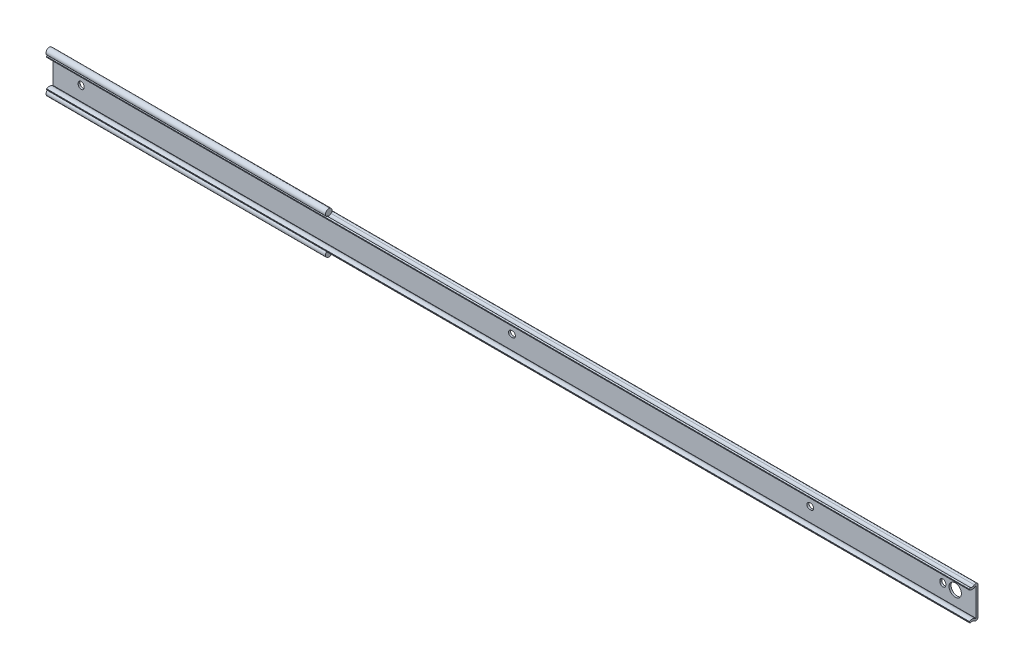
ISO-10303-21;
HEADER;
FILE_DESCRIPTION(('STEP AP214'),'2;1');
FILE_NAME('part.step','',(''),(''),'','','');
FILE_SCHEMA(('AUTOMOTIVE_DESIGN { 1 0 10303 214 1 1 1 1 }'));
ENDSEC;
DATA;
#1=APPLICATION_CONTEXT('core data for automotive mechanical design processes');
#2=APPLICATION_PROTOCOL_DEFINITION('international standard','automotive_design',2000,#1);
#3=PRODUCT_CONTEXT('',#1,'mechanical');
#4=PRODUCT('Part','Part','',(#3));
#5=PRODUCT_RELATED_PRODUCT_CATEGORY('part','',(#4));
#6=PRODUCT_DEFINITION_FORMATION('','',#4);
#7=PRODUCT_DEFINITION_CONTEXT('part definition',#1,'design');
#8=PRODUCT_DEFINITION('design','',#6,#7);
#9=PRODUCT_DEFINITION_SHAPE('','',#8);
#10=(LENGTH_UNIT() NAMED_UNIT(*) SI_UNIT(.MILLI.,.METRE.));
#11=(NAMED_UNIT(*) PLANE_ANGLE_UNIT() SI_UNIT($,.RADIAN.));
#12=(NAMED_UNIT(*) SI_UNIT($,.STERADIAN.) SOLID_ANGLE_UNIT());
#13=UNCERTAINTY_MEASURE_WITH_UNIT(LENGTH_MEASURE(1.E-05),#10,'distance_accuracy_value','');
#14=(GEOMETRIC_REPRESENTATION_CONTEXT(3) GLOBAL_UNCERTAINTY_ASSIGNED_CONTEXT((#13)) GLOBAL_UNIT_ASSIGNED_CONTEXT((#10,
#11,#12)) REPRESENTATION_CONTEXT('',''));
#15=CARTESIAN_POINT('',(0.,0.,0.));
#16=DIRECTION('',(0.,0.,1.));
#17=DIRECTION('',(1.,0.,0.));
#18=AXIS2_PLACEMENT_3D('',#15,#16,#17);
#19=CARTESIAN_POINT('',(-21.4,13.9150000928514,4.44999970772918));
#20=DIRECTION('',(1.,0.,0.));
#21=DIRECTION('',(0.,0.,-1.));
#22=AXIS2_PLACEMENT_3D('',#19,#20,#21);
#23=CYLINDRICAL_SURFACE('',#22,2.55000008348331);
#24=DIRECTION('',(1.,0.,0.));
#25=VECTOR('',#24,1.);
#26=CARTESIAN_POINT('',(-21.4,12.0053612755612,2.76009438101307));
#27=LINE('',#26,#25);
#28=CARTESIAN_POINT('',(192.8,12.0053612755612,2.76009438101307));
#29=VERTEX_POINT('',#28);
#30=CARTESIAN_POINT('',(685.8,12.0053612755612,2.76009438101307));
#31=VERTEX_POINT('',#30);
#32=EDGE_CURVE('E406',#29,#31,#27,.T.);
#33=ORIENTED_EDGE('',*,*,#32,.F.);
#34=CARTESIAN_POINT('',(192.8,13.9150000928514,4.44999970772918));
#35=DIRECTION('',(-1.,0.,0.));
#36=DIRECTION('',(0.,0.,1.));
#37=AXIS2_PLACEMENT_3D('',#34,#35,#36);
#38=CIRCLE('',#37,2.55000008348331);
#39=CARTESIAN_POINT('',(192.8,11.8784794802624,5.98462807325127));
#40=VERTEX_POINT('',#39);
#41=EDGE_CURVE('E468',#29,#40,#38,.T.);
#42=ORIENTED_EDGE('',*,*,#41,.T.);
#43=DIRECTION('',(1.,0.,0.));
#44=VECTOR('',#43,1.);
#45=CARTESIAN_POINT('',(-21.4,11.8784794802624,5.98462807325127));
#46=LINE('',#45,#44);
#47=CARTESIAN_POINT('',(685.8,11.8784794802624,5.98462807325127));
#48=VERTEX_POINT('',#47);
#49=EDGE_CURVE('E432',#40,#48,#46,.T.);
#50=ORIENTED_EDGE('',*,*,#49,.T.);
#51=CARTESIAN_POINT('',(685.8,13.9150000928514,4.44999970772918));
#52=DIRECTION('',(-1.,0.,0.));
#53=DIRECTION('',(0.,0.,-1.));
#54=AXIS2_PLACEMENT_3D('',#51,#52,#53);
#55=CIRCLE('',#54,2.55000008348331);
#56=EDGE_CURVE('E336',#31,#48,#55,.T.);
#57=ORIENTED_EDGE('',*,*,#56,.F.);
#58=EDGE_LOOP('',(#33,#42,#50,#57));
#59=FACE_BOUND('',#58,.T.);
#60=ADVANCED_FACE('F14',(#59),#23,.F.);
#61=CARTESIAN_POINT('',(-21.4,10.762224,1.65999962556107));
#62=DIRECTION('',(1.,0.,0.));
#63=DIRECTION('',(0.,0.,-1.));
#64=AXIS2_PLACEMENT_3D('',#61,#62,#63);
#65=CYLINDRICAL_SURFACE('',#64,1.65999962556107);
#66=DIRECTION('',(-1.,0.,0.));
#67=VECTOR('',#66,1.);
#68=CARTESIAN_POINT('',(85.7,12.2965303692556,2.29364205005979));
#69=LINE('',#68,#67);
#70=CARTESIAN_POINT('',(192.8,12.2965303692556,2.29364205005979));
#71=VERTEX_POINT('',#70);
#72=CARTESIAN_POINT('',(-21.4,12.2965303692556,2.29364205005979));
#73=VERTEX_POINT('',#72);
#74=EDGE_CURVE('E316',#71,#73,#69,.T.);
#75=ORIENTED_EDGE('',*,*,#74,.F.);
#76=CARTESIAN_POINT('',(192.8,10.762224,1.65999962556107));
#77=DIRECTION('',(-1.,0.,0.));
#78=DIRECTION('',(0.,0.,1.));
#79=AXIS2_PLACEMENT_3D('',#76,#77,#78);
#80=CIRCLE('',#79,1.65999962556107);
#81=EDGE_CURVE('E489',#71,#29,#80,.F.);
#82=ORIENTED_EDGE('',*,*,#81,.T.);
#83=ORIENTED_EDGE('',*,*,#32,.T.);
#84=CARTESIAN_POINT('',(685.8,10.762224,1.65999962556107));
#85=DIRECTION('',(1.,0.,0.));
#86=DIRECTION('',(0.,0.,-1.));
#87=AXIS2_PLACEMENT_3D('',#84,#85,#86);
#88=CIRCLE('',#87,1.65999962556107);
#89=CARTESIAN_POINT('',(685.8,10.762224,0.));
#90=VERTEX_POINT('',#89);
#91=EDGE_CURVE('E333',#90,#31,#88,.T.);
#92=ORIENTED_EDGE('',*,*,#91,.F.);
#93=DIRECTION('',(1.,0.,0.));
#94=VECTOR('',#93,1.);
#95=CARTESIAN_POINT('',(-21.4,10.762224,0.));
#96=LINE('',#95,#94);
#97=CARTESIAN_POINT('',(-21.4,10.762224,0.));
#98=VERTEX_POINT('',#97);
#99=EDGE_CURVE('E407',#98,#90,#96,.T.);
#100=ORIENTED_EDGE('',*,*,#99,.F.);
#101=CARTESIAN_POINT('',(-21.4,10.762224,1.65999962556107));
#102=DIRECTION('',(1.,0.,0.));
#103=DIRECTION('',(0.,0.,-1.));
#104=AXIS2_PLACEMENT_3D('',#101,#102,#103);
#105=CIRCLE('',#104,1.65999962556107);
#106=EDGE_CURVE('E376',#98,#73,#105,.T.);
#107=ORIENTED_EDGE('',*,*,#106,.T.);
#108=EDGE_LOOP('',(#75,#82,#83,#92,#100,#107));
#109=FACE_BOUND('',#108,.T.);
#110=ADVANCED_FACE('F16',(#109),#65,.T.);
#111=CARTESIAN_POINT('',(-21.4,-10.7622240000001,0.));
#112=DIRECTION('',(0.,0.,-1.));
#113=DIRECTION('',(-1.,0.,0.));
#114=AXIS2_PLACEMENT_3D('',#111,#112,#113);
#115=PLANE('',#114);
#116=CARTESIAN_POINT('',(669.9,0.,0.));
#117=DIRECTION('',(0.,0.,-1.));
#118=DIRECTION('',(-1.,0.,0.));
#119=AXIS2_PLACEMENT_3D('',#116,#117,#118);
#120=CIRCLE('',#119,4.75);
#121=CARTESIAN_POINT('',(665.15,0.,0.));
#122=VERTEX_POINT('',#121);
#123=EDGE_CURVE('E269',#122,#122,#120,.T.);
#124=ORIENTED_EDGE('',*,*,#123,.F.);
#125=EDGE_LOOP('',(#124));
#126=FACE_BOUND('',#125,.T.);
#127=CARTESIAN_POINT('',(660.4,0.399999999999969,0.));
#128=DIRECTION('',(0.,0.,-1.));
#129=DIRECTION('',(-1.,0.,0.));
#130=AXIS2_PLACEMENT_3D('',#127,#128,#129);
#131=CIRCLE('',#130,2.25);
#132=CARTESIAN_POINT('',(658.15,0.399999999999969,0.));
#133=VERTEX_POINT('',#132);
#134=CARTESIAN_POINT('',(662.65,0.399999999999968,0.));
#135=VERTEX_POINT('',#134);
#136=EDGE_CURVE('E257',#133,#135,#131,.T.);
#137=ORIENTED_EDGE('',*,*,#136,.F.);
#138=DIRECTION('',(0.,1.,0.));
#139=VECTOR('',#138,1.);
#140=CARTESIAN_POINT('',(658.15,0.399999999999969,0.));
#141=LINE('',#140,#139);
#142=CARTESIAN_POINT('',(658.15,-0.400000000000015,0.));
#143=VERTEX_POINT('',#142);
#144=EDGE_CURVE('E262',#143,#133,#141,.T.);
#145=ORIENTED_EDGE('',*,*,#144,.F.);
#146=CARTESIAN_POINT('',(660.4,-0.400000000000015,0.));
#147=DIRECTION('',(0.,0.,-1.));
#148=DIRECTION('',(-1.,0.,0.));
#149=AXIS2_PLACEMENT_3D('',#146,#147,#148);
#150=CIRCLE('',#149,2.25);
#151=CARTESIAN_POINT('',(662.65,-0.400000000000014,0.));
#152=VERTEX_POINT('',#151);
#153=EDGE_CURVE('E241',#152,#143,#150,.T.);
#154=ORIENTED_EDGE('',*,*,#153,.F.);
#155=DIRECTION('',(0.,-1.,0.));
#156=VECTOR('',#155,1.);
#157=CARTESIAN_POINT('',(662.65,0.399999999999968,0.));
#158=LINE('',#157,#156);
#159=EDGE_CURVE('E252',#135,#152,#158,.T.);
#160=ORIENTED_EDGE('',*,*,#159,.F.);
#161=EDGE_LOOP('',(#137,#145,#154,#160));
#162=FACE_BOUND('',#161,.T.);
#163=CARTESIAN_POINT('',(559.2,0.,0.));
#164=DIRECTION('',(0.,0.,-1.));
#165=DIRECTION('',(-1.,0.,0.));
#166=AXIS2_PLACEMENT_3D('',#163,#164,#165);
#167=CIRCLE('',#166,2.25);
#168=CARTESIAN_POINT('',(559.2,2.24999999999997,0.));
#169=VERTEX_POINT('',#168);
#170=CARTESIAN_POINT('',(559.2,-2.25000000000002,0.));
#171=VERTEX_POINT('',#170);
#172=EDGE_CURVE('E272',#169,#171,#167,.T.);
#173=ORIENTED_EDGE('',*,*,#172,.F.);
#174=DIRECTION('',(1.,0.,0.));
#175=VECTOR('',#174,1.);
#176=CARTESIAN_POINT('',(559.2,2.24999999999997,0.));
#177=LINE('',#176,#175);
#178=CARTESIAN_POINT('',(558.4,2.24999999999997,0.));
#179=VERTEX_POINT('',#178);
#180=EDGE_CURVE('E281',#179,#169,#177,.T.);
#181=ORIENTED_EDGE('',*,*,#180,.F.);
#182=CARTESIAN_POINT('',(558.4,0.,0.));
#183=DIRECTION('',(0.,0.,-1.));
#184=DIRECTION('',(-1.,0.,0.));
#185=AXIS2_PLACEMENT_3D('',#182,#183,#184);
#186=CIRCLE('',#185,2.25);
#187=CARTESIAN_POINT('',(558.4,-2.25000000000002,0.));
#188=VERTEX_POINT('',#187);
#189=EDGE_CURVE('E278',#188,#179,#186,.T.);
#190=ORIENTED_EDGE('',*,*,#189,.F.);
#191=DIRECTION('',(-1.,0.,0.));
#192=VECTOR('',#191,1.);
#193=CARTESIAN_POINT('',(559.2,-2.25000000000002,0.));
#194=LINE('',#193,#192);
#195=EDGE_CURVE('E274',#171,#188,#194,.T.);
#196=ORIENTED_EDGE('',*,*,#195,.F.);
#197=EDGE_LOOP('',(#173,#181,#190,#196));
#198=FACE_BOUND('',#197,.T.);
#199=CARTESIAN_POINT('',(0.,0.399999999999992,0.));
#200=DIRECTION('',(0.,0.,-1.));
#201=DIRECTION('',(-1.,0.,0.));
#202=AXIS2_PLACEMENT_3D('',#199,#200,#201);
#203=CIRCLE('',#202,2.24999999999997);
#204=CARTESIAN_POINT('',(-2.24999999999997,0.399999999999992,0.));
#205=VERTEX_POINT('',#204);
#206=CARTESIAN_POINT('',(2.24999999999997,0.399999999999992,0.));
#207=VERTEX_POINT('',#206);
#208=EDGE_CURVE('E293',#205,#207,#203,.T.);
#209=ORIENTED_EDGE('',*,*,#208,.F.);
#210=DIRECTION('',(0.,1.,0.));
#211=VECTOR('',#210,1.);
#212=CARTESIAN_POINT('',(-2.24999999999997,0.399999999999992,0.));
#213=LINE('',#212,#211);
#214=CARTESIAN_POINT('',(-2.24999999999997,-0.399999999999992,0.));
#215=VERTEX_POINT('',#214);
#216=EDGE_CURVE('E302',#215,#205,#213,.T.);
#217=ORIENTED_EDGE('',*,*,#216,.F.);
#218=CARTESIAN_POINT('',(0.,-0.399999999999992,0.));
#219=DIRECTION('',(0.,0.,-1.));
#220=DIRECTION('',(-1.,0.,0.));
#221=AXIS2_PLACEMENT_3D('',#218,#219,#220);
#222=CIRCLE('',#221,2.24999999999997);
#223=CARTESIAN_POINT('',(2.24999999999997,-0.399999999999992,0.));
#224=VERTEX_POINT('',#223);
#225=EDGE_CURVE('E299',#224,#215,#222,.T.);
#226=ORIENTED_EDGE('',*,*,#225,.F.);
#227=DIRECTION('',(0.,-1.,0.));
#228=VECTOR('',#227,1.);
#229=CARTESIAN_POINT('',(2.24999999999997,0.399999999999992,0.));
#230=LINE('',#229,#228);
#231=EDGE_CURVE('E295',#207,#224,#230,.T.);
#232=ORIENTED_EDGE('',*,*,#231,.F.);
#233=EDGE_LOOP('',(#209,#217,#226,#232));
#234=FACE_BOUND('',#233,.T.);
#235=CARTESIAN_POINT('',(330.6,0.,0.));
#236=DIRECTION('',(0.,0.,-1.));
#237=DIRECTION('',(-1.,0.,0.));
#238=AXIS2_PLACEMENT_3D('',#235,#236,#237);
#239=CIRCLE('',#238,2.25);
#240=CARTESIAN_POINT('',(330.6,2.25000000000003,0.));
#241=VERTEX_POINT('',#240);
#242=CARTESIAN_POINT('',(330.6,-2.24999999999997,0.));
#243=VERTEX_POINT('',#242);
#244=EDGE_CURVE('E313',#241,#243,#239,.T.);
#245=ORIENTED_EDGE('',*,*,#244,.F.);
#246=DIRECTION('',(1.,0.,0.));
#247=VECTOR('',#246,1.);
#248=CARTESIAN_POINT('',(330.6,2.25000000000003,0.));
#249=LINE('',#248,#247);
#250=CARTESIAN_POINT('',(329.8,2.25000000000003,0.));
#251=VERTEX_POINT('',#250);
#252=EDGE_CURVE('E322',#251,#241,#249,.T.);
#253=ORIENTED_EDGE('',*,*,#252,.F.);
#254=CARTESIAN_POINT('',(329.8,0.,0.));
#255=DIRECTION('',(0.,0.,-1.));
#256=DIRECTION('',(-1.,0.,0.));
#257=AXIS2_PLACEMENT_3D('',#254,#255,#256);
#258=CIRCLE('',#257,2.25);
#259=CARTESIAN_POINT('',(329.8,-2.24999999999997,0.));
#260=VERTEX_POINT('',#259);
#261=EDGE_CURVE('E319',#260,#251,#258,.T.);
#262=ORIENTED_EDGE('',*,*,#261,.F.);
#263=DIRECTION('',(-1.,0.,0.));
#264=VECTOR('',#263,1.);
#265=CARTESIAN_POINT('',(330.6,-2.24999999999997,0.));
#266=LINE('',#265,#264);
#267=EDGE_CURVE('E315',#243,#260,#266,.T.);
#268=ORIENTED_EDGE('',*,*,#267,.F.);
#269=EDGE_LOOP('',(#245,#253,#262,#268));
#270=FACE_BOUND('',#269,.T.);
#271=DIRECTION('',(0.,1.,0.));
#272=VECTOR('',#271,1.);
#273=CARTESIAN_POINT('',(-21.4,-10.7622240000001,0.));
#274=LINE('',#273,#272);
#275=CARTESIAN_POINT('',(-21.4,-10.7622240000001,0.));
#276=VERTEX_POINT('',#275);
#277=EDGE_CURVE('E404',#276,#98,#274,.T.);
#278=ORIENTED_EDGE('',*,*,#277,.T.);
#279=ORIENTED_EDGE('',*,*,#99,.T.);
#280=DIRECTION('',(0.,1.,0.));
#281=VECTOR('',#280,1.);
#282=CARTESIAN_POINT('',(685.8,-10.7622240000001,0.));
#283=LINE('',#282,#281);
#284=CARTESIAN_POINT('',(685.8,-10.7622240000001,0.));
#285=VERTEX_POINT('',#284);
#286=EDGE_CURVE('E373',#285,#90,#283,.T.);
#287=ORIENTED_EDGE('',*,*,#286,.F.);
#288=DIRECTION('',(1.,0.,0.));
#289=VECTOR('',#288,1.);
#290=CARTESIAN_POINT('',(-21.4,-10.7622240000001,0.));
#291=LINE('',#290,#289);
#292=EDGE_CURVE('E410',#276,#285,#291,.T.);
#293=ORIENTED_EDGE('',*,*,#292,.F.);
#294=EDGE_LOOP('',(#278,#279,#287,#293));
#295=FACE_BOUND('',#294,.T.);
#296=ADVANCED_FACE('F259',(#126,#162,#198,#234,#270,#295),#115,.T.);
#297=CARTESIAN_POINT('',(-21.4,-10.7622240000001,1.65999962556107));
#298=DIRECTION('',(1.,0.,0.));
#299=DIRECTION('',(0.,0.,-1.));
#300=AXIS2_PLACEMENT_3D('',#297,#298,#299);
#301=CYLINDRICAL_SURFACE('',#300,1.65999962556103);
#302=DIRECTION('',(-1.,0.,0.));
#303=VECTOR('',#302,1.);
#304=CARTESIAN_POINT('',(85.7,-12.2965303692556,2.29364205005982));
#305=LINE('',#304,#303);
#306=CARTESIAN_POINT('',(-21.4,-12.2965303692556,2.29364205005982));
#307=VERTEX_POINT('',#306);
#308=CARTESIAN_POINT('',(192.8,-12.2965303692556,2.29364205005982));
#309=VERTEX_POINT('',#308);
#310=EDGE_CURVE('E583',#307,#309,#305,.F.);
#311=ORIENTED_EDGE('',*,*,#310,.F.);
#312=CARTESIAN_POINT('',(-21.4,-10.7622240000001,1.65999962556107));
#313=DIRECTION('',(1.,0.,0.));
#314=DIRECTION('',(0.,0.,1.));
#315=AXIS2_PLACEMENT_3D('',#312,#313,#314);
#316=CIRCLE('',#315,1.65999962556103);
#317=EDGE_CURVE('E402',#307,#276,#316,.T.);
#318=ORIENTED_EDGE('',*,*,#317,.T.);
#319=ORIENTED_EDGE('',*,*,#292,.T.);
#320=CARTESIAN_POINT('',(685.8,-10.7622240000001,1.65999962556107));
#321=DIRECTION('',(1.,0.,0.));
#322=DIRECTION('',(0.,0.,1.));
#323=AXIS2_PLACEMENT_3D('',#320,#321,#322);
#324=CIRCLE('',#323,1.65999962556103);
#325=CARTESIAN_POINT('',(685.8,-12.0036867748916,2.76198371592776));
#326=VERTEX_POINT('',#325);
#327=EDGE_CURVE('E370',#326,#285,#324,.T.);
#328=ORIENTED_EDGE('',*,*,#327,.F.);
#329=DIRECTION('',(1.,0.,0.));
#330=VECTOR('',#329,1.);
#331=CARTESIAN_POINT('',(-21.4,-12.0036867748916,2.76198371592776));
#332=LINE('',#331,#330);
#333=CARTESIAN_POINT('',(192.8,-12.0036867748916,2.76198371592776));
#334=VERTEX_POINT('',#333);
#335=EDGE_CURVE('E412',#334,#326,#332,.T.);
#336=ORIENTED_EDGE('',*,*,#335,.F.);
#337=CARTESIAN_POINT('',(192.8,-10.7622240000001,1.65999962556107));
#338=DIRECTION('',(1.,0.,0.));
#339=DIRECTION('',(0.,0.,-1.));
#340=AXIS2_PLACEMENT_3D('',#337,#338,#339);
#341=CIRCLE('',#340,1.65999962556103);
#342=EDGE_CURVE('E29',#309,#334,#341,.F.);
#343=ORIENTED_EDGE('',*,*,#342,.F.);
#344=EDGE_LOOP('',(#311,#318,#319,#328,#336,#343));
#345=FACE_BOUND('',#344,.T.);
#346=ADVANCED_FACE('F574',(#345),#301,.T.);
#347=CARTESIAN_POINT('',(-21.4,-13.9149976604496,4.44999754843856));
#348=DIRECTION('',(1.,0.,0.));
#349=DIRECTION('',(0.,0.,-1.));
#350=AXIS2_PLACEMENT_3D('',#347,#348,#349);
#351=CYLINDRICAL_SURFACE('',#350,2.55000000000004);
#352=CARTESIAN_POINT('',(192.8,-13.9149976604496,4.44999754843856));
#353=DIRECTION('',(1.,0.,0.));
#354=DIRECTION('',(0.,0.,-1.));
#355=AXIS2_PLACEMENT_3D('',#352,#353,#354);
#356=CIRCLE('',#355,2.55000000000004);
#357=CARTESIAN_POINT('',(192.8,-11.8784773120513,5.98462612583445));
#358=VERTEX_POINT('',#357);
#359=EDGE_CURVE('E37',#334,#358,#356,.T.);
#360=ORIENTED_EDGE('',*,*,#359,.F.);
#361=ORIENTED_EDGE('',*,*,#335,.T.);
#362=CARTESIAN_POINT('',(685.8,-13.9149976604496,4.44999754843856));
#363=DIRECTION('',(-1.,0.,0.));
#364=DIRECTION('',(0.,0.,1.));
#365=AXIS2_PLACEMENT_3D('',#362,#363,#364);
#366=CIRCLE('',#365,2.55000000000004);
#367=CARTESIAN_POINT('',(685.8,-11.8784773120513,5.98462612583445));
#368=VERTEX_POINT('',#367);
#369=EDGE_CURVE('E367',#368,#326,#366,.T.);
#370=ORIENTED_EDGE('',*,*,#369,.F.);
#371=DIRECTION('',(1.,0.,0.));
#372=VECTOR('',#371,1.);
#373=CARTESIAN_POINT('',(-21.4,-11.8784773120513,5.98462612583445));
#374=LINE('',#373,#372);
#375=EDGE_CURVE('E414',#358,#368,#374,.T.);
#376=ORIENTED_EDGE('',*,*,#375,.F.);
#377=EDGE_LOOP('',(#360,#361,#370,#376));
#378=FACE_BOUND('',#377,.T.);
#379=ADVANCED_FACE('F577',(#378),#351,.F.);
#380=CARTESIAN_POINT('',(-21.4,-11.8784773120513,5.98462612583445));
#381=DIRECTION('',(0.,-0.601815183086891,0.798635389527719));
#382=DIRECTION('',(0.,-0.798635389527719,-0.601815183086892));
#383=AXIS2_PLACEMENT_3D('',#380,#381,#382);
#384=PLANE('',#383);
#385=DIRECTION('',(-1.,0.,0.));
#386=VECTOR('',#385,1.);
#387=CARTESIAN_POINT('',(192.8,-11.641839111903,6.1629458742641));
#388=LINE('',#387,#386);
#389=CARTESIAN_POINT('',(192.8,-11.641839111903,6.1629458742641));
#390=VERTEX_POINT('',#389);
#391=CARTESIAN_POINT('',(-21.4,-11.641839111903,6.1629458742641));
#392=VERTEX_POINT('',#391);
#393=EDGE_CURVE('E584',#390,#392,#388,.T.);
#394=ORIENTED_EDGE('',*,*,#393,.F.);
#395=DIRECTION('',(0.,0.798635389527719,0.601815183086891));
#396=VECTOR('',#395,1.);
#397=CARTESIAN_POINT('',(192.8,-11.8784773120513,5.98462612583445));
#398=LINE('',#397,#396);
#399=EDGE_CURVE('E9',#358,#390,#398,.T.);
#400=ORIENTED_EDGE('',*,*,#399,.F.);
#401=ORIENTED_EDGE('',*,*,#375,.T.);
#402=DIRECTION('',(0.,-0.798635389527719,-0.601815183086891));
#403=VECTOR('',#402,1.);
#404=CARTESIAN_POINT('',(685.8,-11.8784773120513,5.98462612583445));
#405=LINE('',#404,#403);
#406=CARTESIAN_POINT('',(685.8,-11.0618545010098,6.59999580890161));
#407=VERTEX_POINT('',#406);
#408=EDGE_CURVE('E364',#407,#368,#405,.T.);
#409=ORIENTED_EDGE('',*,*,#408,.F.);
#410=DIRECTION('',(1.,0.,0.));
#411=VECTOR('',#410,1.);
#412=CARTESIAN_POINT('',(-21.4,-11.0618545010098,6.59999580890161));
#413=LINE('',#412,#411);
#414=CARTESIAN_POINT('',(-21.4,-11.0618545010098,6.59999580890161));
#415=VERTEX_POINT('',#414);
#416=EDGE_CURVE('E416',#415,#407,#413,.T.);
#417=ORIENTED_EDGE('',*,*,#416,.F.);
#418=DIRECTION('',(0.,-0.798635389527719,-0.601815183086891));
#419=VECTOR('',#418,1.);
#420=CARTESIAN_POINT('',(-21.4,-11.8784773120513,5.98462612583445));
#421=LINE('',#420,#419);
#422=EDGE_CURVE('E400',#415,#392,#421,.T.);
#423=ORIENTED_EDGE('',*,*,#422,.T.);
#424=EDGE_LOOP('',(#394,#400,#401,#409,#417,#423));
#425=FACE_BOUND('',#424,.T.);
#426=ADVANCED_FACE('F511',(#425),#384,.T.);
#427=CARTESIAN_POINT('',(-21.4,-10.7845049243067,1.54999983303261));
#428=DIRECTION('',(0.,0.,1.));
#429=DIRECTION('',(0.,-1.,0.));
#430=AXIS2_PLACEMENT_3D('',#427,#428,#429);
#431=PLANE('',#430);
#432=CARTESIAN_POINT('',(669.9,0.,1.54999983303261));
#433=DIRECTION('',(0.,0.,1.));
#434=DIRECTION('',(0.,-1.,0.));
#435=AXIS2_PLACEMENT_3D('',#432,#433,#434);
#436=CIRCLE('',#435,4.75);
#437=CARTESIAN_POINT('',(669.9,-4.75000000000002,1.54999983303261));
#438=VERTEX_POINT('',#437);
#439=EDGE_CURVE('E337',#438,#438,#436,.T.);
#440=ORIENTED_EDGE('',*,*,#439,.F.);
#441=EDGE_LOOP('',(#440));
#442=FACE_BOUND('',#441,.T.);
#443=CARTESIAN_POINT('',(660.4,0.399999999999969,1.54999983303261));
#444=DIRECTION('',(0.,0.,1.));
#445=DIRECTION('',(0.,-1.,0.));
#446=AXIS2_PLACEMENT_3D('',#443,#444,#445);
#447=CIRCLE('',#446,2.25);
#448=CARTESIAN_POINT('',(662.65,0.399999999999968,1.54999983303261));
#449=VERTEX_POINT('',#448);
#450=CARTESIAN_POINT('',(658.15,0.399999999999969,1.54999983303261));
#451=VERTEX_POINT('',#450);
#452=EDGE_CURVE('E466',#449,#451,#447,.T.);
#453=ORIENTED_EDGE('',*,*,#452,.F.);
#454=DIRECTION('',(0.,1.,0.));
#455=VECTOR('',#454,1.);
#456=CARTESIAN_POINT('',(662.65,-10.7845049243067,1.54999983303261));
#457=LINE('',#456,#455);
#458=CARTESIAN_POINT('',(662.65,-0.400000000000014,1.54999983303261));
#459=VERTEX_POINT('',#458);
#460=EDGE_CURVE('E461',#459,#449,#457,.T.);
#461=ORIENTED_EDGE('',*,*,#460,.F.);
#462=CARTESIAN_POINT('',(660.4,-0.400000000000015,1.54999983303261));
#463=DIRECTION('',(0.,0.,1.));
#464=DIRECTION('',(0.,-1.,0.));
#465=AXIS2_PLACEMENT_3D('',#462,#463,#464);
#466=CIRCLE('',#465,2.25);
#467=CARTESIAN_POINT('',(658.15,-0.400000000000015,1.54999983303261));
#468=VERTEX_POINT('',#467);
#469=EDGE_CURVE('E244',#468,#459,#466,.T.);
#470=ORIENTED_EDGE('',*,*,#469,.F.);
#471=DIRECTION('',(0.,-1.,0.));
#472=VECTOR('',#471,1.);
#473=CARTESIAN_POINT('',(658.15,-10.7845049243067,1.54999983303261));
#474=LINE('',#473,#472);
#475=EDGE_CURVE('E464',#451,#468,#474,.T.);
#476=ORIENTED_EDGE('',*,*,#475,.F.);
#477=EDGE_LOOP('',(#453,#461,#470,#476));
#478=FACE_BOUND('',#477,.T.);
#479=CARTESIAN_POINT('',(559.2,0.,1.54999983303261));
#480=DIRECTION('',(0.,0.,1.));
#481=DIRECTION('',(0.,-1.,0.));
#482=AXIS2_PLACEMENT_3D('',#479,#480,#481);
#483=CIRCLE('',#482,2.25);
#484=CARTESIAN_POINT('',(559.2,-2.25000000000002,1.54999983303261));
#485=VERTEX_POINT('',#484);
#486=CARTESIAN_POINT('',(559.2,2.24999999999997,1.54999983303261));
#487=VERTEX_POINT('',#486);
#488=EDGE_CURVE('E459',#485,#487,#483,.T.);
#489=ORIENTED_EDGE('',*,*,#488,.F.);
#490=DIRECTION('',(1.,0.,0.));
#491=VECTOR('',#490,1.);
#492=CARTESIAN_POINT('',(-21.4,-2.25000000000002,1.54999983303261));
#493=LINE('',#492,#491);
#494=CARTESIAN_POINT('',(558.4,-2.25000000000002,1.54999983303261));
#495=VERTEX_POINT('',#494);
#496=EDGE_CURVE('E452',#495,#485,#493,.T.);
#497=ORIENTED_EDGE('',*,*,#496,.F.);
#498=CARTESIAN_POINT('',(558.4,0.,1.54999983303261));
#499=DIRECTION('',(0.,0.,1.));
#500=DIRECTION('',(0.,-1.,0.));
#501=AXIS2_PLACEMENT_3D('',#498,#499,#500);
#502=CIRCLE('',#501,2.25);
#503=CARTESIAN_POINT('',(558.4,2.24999999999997,1.54999983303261));
#504=VERTEX_POINT('',#503);
#505=EDGE_CURVE('E454',#504,#495,#502,.T.);
#506=ORIENTED_EDGE('',*,*,#505,.F.);
#507=DIRECTION('',(-1.,0.,0.));
#508=VECTOR('',#507,1.);
#509=CARTESIAN_POINT('',(-21.4,2.24999999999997,1.54999983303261));
#510=LINE('',#509,#508);
#511=EDGE_CURVE('E457',#487,#504,#510,.T.);
#512=ORIENTED_EDGE('',*,*,#511,.F.);
#513=EDGE_LOOP('',(#489,#497,#506,#512));
#514=FACE_BOUND('',#513,.T.);
#515=CARTESIAN_POINT('',(0.,0.399999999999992,1.54999983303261));
#516=DIRECTION('',(0.,0.,1.));
#517=DIRECTION('',(0.,-1.,0.));
#518=AXIS2_PLACEMENT_3D('',#515,#516,#517);
#519=CIRCLE('',#518,2.24999999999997);
#520=CARTESIAN_POINT('',(2.24999999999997,0.399999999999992,1.54999983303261));
#521=VERTEX_POINT('',#520);
#522=CARTESIAN_POINT('',(-2.24999999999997,0.399999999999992,1.54999983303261));
#523=VERTEX_POINT('',#522);
#524=EDGE_CURVE('E450',#521,#523,#519,.T.);
#525=ORIENTED_EDGE('',*,*,#524,.F.);
#526=DIRECTION('',(0.,1.,0.));
#527=VECTOR('',#526,1.);
#528=CARTESIAN_POINT('',(2.24999999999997,-10.7845049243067,1.54999983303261));
#529=LINE('',#528,#527);
#530=CARTESIAN_POINT('',(2.24999999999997,-0.399999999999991,1.54999983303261));
#531=VERTEX_POINT('',#530);
#532=EDGE_CURVE('E443',#531,#521,#529,.T.);
#533=ORIENTED_EDGE('',*,*,#532,.F.);
#534=CARTESIAN_POINT('',(0.,-0.399999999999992,1.54999983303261));
#535=DIRECTION('',(0.,0.,1.));
#536=DIRECTION('',(0.,-1.,0.));
#537=AXIS2_PLACEMENT_3D('',#534,#535,#536);
#538=CIRCLE('',#537,2.24999999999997);
#539=CARTESIAN_POINT('',(-2.24999999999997,-0.399999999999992,1.54999983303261));
#540=VERTEX_POINT('',#539);
#541=EDGE_CURVE('E445',#540,#531,#538,.T.);
#542=ORIENTED_EDGE('',*,*,#541,.F.);
#543=DIRECTION('',(0.,-1.,0.));
#544=VECTOR('',#543,1.);
#545=CARTESIAN_POINT('',(-2.24999999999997,-10.7845049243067,1.54999983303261));
#546=LINE('',#545,#544);
#547=EDGE_CURVE('E448',#523,#540,#546,.T.);
#548=ORIENTED_EDGE('',*,*,#547,.F.);
#549=EDGE_LOOP('',(#525,#533,#542,#548));
#550=FACE_BOUND('',#549,.T.);
#551=CARTESIAN_POINT('',(330.6,0.,1.54999983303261));
#552=DIRECTION('',(0.,0.,1.));
#553=DIRECTION('',(0.,-1.,0.));
#554=AXIS2_PLACEMENT_3D('',#551,#552,#553);
#555=CIRCLE('',#554,2.25);
#556=CARTESIAN_POINT('',(330.6,-2.24999999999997,1.54999983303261));
#557=VERTEX_POINT('',#556);
#558=CARTESIAN_POINT('',(330.6,2.25000000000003,1.54999983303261));
#559=VERTEX_POINT('',#558);
#560=EDGE_CURVE('E441',#557,#559,#555,.T.);
#561=ORIENTED_EDGE('',*,*,#560,.F.);
#562=DIRECTION('',(1.,0.,0.));
#563=VECTOR('',#562,1.);
#564=CARTESIAN_POINT('',(-21.4,-2.24999999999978,1.54999983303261));
#565=LINE('',#564,#563);
#566=CARTESIAN_POINT('',(329.8,-2.24999999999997,1.54999983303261));
#567=VERTEX_POINT('',#566);
#568=EDGE_CURVE('E409',#567,#557,#565,.T.);
#569=ORIENTED_EDGE('',*,*,#568,.F.);
#570=CARTESIAN_POINT('',(329.8,0.,1.54999983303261));
#571=DIRECTION('',(0.,0.,1.));
#572=DIRECTION('',(0.,-1.,0.));
#573=AXIS2_PLACEMENT_3D('',#570,#571,#572);
#574=CIRCLE('',#573,2.25);
#575=CARTESIAN_POINT('',(329.8,2.25000000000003,1.54999983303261));
#576=VERTEX_POINT('',#575);
#577=EDGE_CURVE('E436',#576,#567,#574,.T.);
#578=ORIENTED_EDGE('',*,*,#577,.F.);
#579=DIRECTION('',(-1.,0.,0.));
#580=VECTOR('',#579,1.);
#581=CARTESIAN_POINT('',(-21.4,2.25000000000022,1.54999983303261));
#582=LINE('',#581,#580);
#583=EDGE_CURVE('E439',#559,#576,#582,.T.);
#584=ORIENTED_EDGE('',*,*,#583,.F.);
#585=EDGE_LOOP('',(#561,#569,#578,#584));
#586=FACE_BOUND('',#585,.T.);
#587=DIRECTION('',(0.,-1.,0.));
#588=VECTOR('',#587,1.);
#589=CARTESIAN_POINT('',(-21.4,-10.7845049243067,1.54999983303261));
#590=LINE('',#589,#588);
#591=CARTESIAN_POINT('',(-21.4,10.7845049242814,1.54999983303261));
#592=VERTEX_POINT('',#591);
#593=CARTESIAN_POINT('',(-21.4,-10.7845049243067,1.54999983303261));
#594=VERTEX_POINT('',#593);
#595=EDGE_CURVE('E389',#592,#594,#590,.T.);
#596=ORIENTED_EDGE('',*,*,#595,.T.);
#597=DIRECTION('',(1.,0.,0.));
#598=VECTOR('',#597,1.);
#599=CARTESIAN_POINT('',(-21.4,-10.7845049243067,1.54999983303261));
#600=LINE('',#599,#598);
#601=CARTESIAN_POINT('',(685.8,-10.7845049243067,1.54999983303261));
#602=VERTEX_POINT('',#601);
#603=EDGE_CURVE('E422',#594,#602,#600,.T.);
#604=ORIENTED_EDGE('',*,*,#603,.T.);
#605=DIRECTION('',(0.,-1.,0.));
#606=VECTOR('',#605,1.);
#607=CARTESIAN_POINT('',(685.8,-10.7845049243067,1.54999983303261));
#608=LINE('',#607,#606);
#609=CARTESIAN_POINT('',(685.8,10.7845049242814,1.54999983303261));
#610=VERTEX_POINT('',#609);
#611=EDGE_CURVE('E352',#610,#602,#608,.T.);
#612=ORIENTED_EDGE('',*,*,#611,.F.);
#613=DIRECTION('',(1.,0.,0.));
#614=VECTOR('',#613,1.);
#615=CARTESIAN_POINT('',(-21.4,10.7845049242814,1.54999983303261));
#616=LINE('',#615,#614);
#617=EDGE_CURVE('E424',#592,#610,#616,.T.);
#618=ORIENTED_EDGE('',*,*,#617,.F.);
#619=EDGE_LOOP('',(#596,#604,#612,#618));
#620=FACE_BOUND('',#619,.T.);
#621=ADVANCED_FACE('F507',(#442,#478,#514,#550,#586,#620),#431,.T.);
#622=CARTESIAN_POINT('',(-21.4,10.762224,1.65999962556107));
#623=DIRECTION('',(1.,0.,0.));
#624=DIRECTION('',(0.,0.,-1.));
#625=AXIS2_PLACEMENT_3D('',#622,#623,#624);
#626=PLANE('',#625);
#627=ORIENTED_EDGE('',*,*,#317,.F.);
#628=CARTESIAN_POINT('',(-21.4,-13.575,4.5));
#629=DIRECTION('',(-1.,0.,0.));
#630=DIRECTION('',(0.,0.,-1.));
#631=AXIS2_PLACEMENT_3D('',#628,#629,#630);
#632=CIRCLE('',#631,2.55);
#633=EDGE_CURVE('E589',#307,#392,#632,.T.);
#634=ORIENTED_EDGE('',*,*,#633,.T.);
#635=ORIENTED_EDGE('',*,*,#422,.F.);
#636=DIRECTION('',(0.,-1.,0.));
#637=VECTOR('',#636,1.);
#638=CARTESIAN_POINT('',(-21.4,-11.0618545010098,6.59999580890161));
#639=LINE('',#638,#637);
#640=CARTESIAN_POINT('',(-21.4,-10.4239404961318,6.59999580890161));
#641=VERTEX_POINT('',#640);
#642=EDGE_CURVE('E397',#641,#415,#639,.T.);
#643=ORIENTED_EDGE('',*,*,#642,.F.);
#644=CARTESIAN_POINT('',(-21.4,-13.9149976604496,4.44999754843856));
#645=DIRECTION('',(1.,0.,0.));
#646=DIRECTION('',(0.,0.,1.));
#647=AXIS2_PLACEMENT_3D('',#644,#645,#646);
#648=CIRCLE('',#647,4.09999666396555);
#649=CARTESIAN_POINT('',(-21.4,-10.8590405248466,1.71666649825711));
#650=VERTEX_POINT('',#649);
#651=EDGE_CURVE('E394',#650,#641,#648,.T.);
#652=ORIENTED_EDGE('',*,*,#651,.F.);
#653=CARTESIAN_POINT('',(-21.4,-10.7845049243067,1.64999983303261));
#654=DIRECTION('',(-1.,0.,0.));
#655=DIRECTION('',(0.,0.,-1.));
#656=AXIS2_PLACEMENT_3D('',#653,#654,#655);
#657=CIRCLE('',#656,0.1);
#658=EDGE_CURVE('E391',#594,#650,#657,.T.);
#659=ORIENTED_EDGE('',*,*,#658,.F.);
#660=ORIENTED_EDGE('',*,*,#595,.F.);
#661=CARTESIAN_POINT('',(-21.4,10.7845049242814,1.64999983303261));
#662=DIRECTION('',(-1.,0.,0.));
#663=DIRECTION('',(0.,0.,1.));
#664=AXIS2_PLACEMENT_3D('',#661,#662,#663);
#665=CIRCLE('',#664,0.1);
#666=CARTESIAN_POINT('',(-21.4,10.8590405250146,1.71666649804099));
#667=VERTEX_POINT('',#666);
#668=EDGE_CURVE('E386',#667,#592,#665,.T.);
#669=ORIENTED_EDGE('',*,*,#668,.F.);
#670=CARTESIAN_POINT('',(-21.4,13.9150000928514,4.44999970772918));
#671=DIRECTION('',(1.,0.,0.));
#672=DIRECTION('',(0.,0.,-1.));
#673=AXIS2_PLACEMENT_3D('',#670,#671,#672);
#674=CIRCLE('',#673,4.09999991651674);
#675=CARTESIAN_POINT('',(-21.4,10.4239401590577,6.59999967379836));
#676=VERTEX_POINT('',#675);
#677=EDGE_CURVE('E383',#676,#667,#674,.T.);
#678=ORIENTED_EDGE('',*,*,#677,.F.);
#679=DIRECTION('',(0.,-1.,1.54366169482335E-08));
#680=VECTOR('',#679,1.);
#681=CARTESIAN_POINT('',(-21.4,11.0618541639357,6.59999966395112));
#682=LINE('',#681,#680);
#683=CARTESIAN_POINT('',(-21.4,11.0618541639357,6.59999966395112));
#684=VERTEX_POINT('',#683);
#685=EDGE_CURVE('E380',#684,#676,#682,.T.);
#686=ORIENTED_EDGE('',*,*,#685,.F.);
#687=DIRECTION('',(0.,-0.798635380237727,0.601815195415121));
#688=VECTOR('',#687,1.);
#689=CARTESIAN_POINT('',(-21.4,11.8784794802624,5.98462807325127));
#690=LINE('',#689,#688);
#691=CARTESIAN_POINT('',(-21.4,11.6418409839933,6.16294805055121));
#692=VERTEX_POINT('',#691);
#693=EDGE_CURVE('E378',#692,#684,#690,.T.);
#694=ORIENTED_EDGE('',*,*,#693,.F.);
#695=CARTESIAN_POINT('',(-21.4,13.575,4.5));
#696=DIRECTION('',(-1.,0.,0.));
#697=DIRECTION('',(0.,0.,1.));
#698=AXIS2_PLACEMENT_3D('',#695,#696,#697);
#699=CIRCLE('',#698,2.55);
#700=EDGE_CURVE('E480',#692,#73,#699,.T.);
#701=ORIENTED_EDGE('',*,*,#700,.T.);
#702=ORIENTED_EDGE('',*,*,#106,.F.);
#703=ORIENTED_EDGE('',*,*,#277,.F.);
#704=EDGE_LOOP('',(#627,#634,#635,#643,#652,#659,#660,#669,#678,#686,#694,#701,#702,#703));
#705=FACE_BOUND('',#704,.T.);
#706=ADVANCED_FACE('F510',(#705),#626,.F.);
#707=CARTESIAN_POINT('',(685.8,10.762224,1.65999962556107));
#708=DIRECTION('',(1.,0.,0.));
#709=DIRECTION('',(0.,0.,-1.));
#710=AXIS2_PLACEMENT_3D('',#707,#708,#709);
#711=PLANE('',#710);
#712=ORIENTED_EDGE('',*,*,#91,.T.);
#713=ORIENTED_EDGE('',*,*,#56,.T.);
#714=DIRECTION('',(0.,-0.798635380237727,0.601815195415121));
#715=VECTOR('',#714,1.);
#716=CARTESIAN_POINT('',(685.8,11.8784794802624,5.98462807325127));
#717=LINE('',#716,#715);
#718=CARTESIAN_POINT('',(685.8,11.0618541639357,6.59999966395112));
#719=VERTEX_POINT('',#718);
#720=EDGE_CURVE('E340',#48,#719,#717,.T.);
#721=ORIENTED_EDGE('',*,*,#720,.T.);
#722=DIRECTION('',(0.,-1.,1.54366169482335E-08));
#723=VECTOR('',#722,1.);
#724=CARTESIAN_POINT('',(685.8,11.0618541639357,6.59999966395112));
#725=LINE('',#724,#723);
#726=CARTESIAN_POINT('',(685.8,10.4239401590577,6.59999967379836));
#727=VERTEX_POINT('',#726);
#728=EDGE_CURVE('E343',#719,#727,#725,.T.);
#729=ORIENTED_EDGE('',*,*,#728,.T.);
#730=CARTESIAN_POINT('',(685.8,13.9150000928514,4.44999970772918));
#731=DIRECTION('',(1.,0.,0.));
#732=DIRECTION('',(0.,0.,-1.));
#733=AXIS2_PLACEMENT_3D('',#730,#731,#732);
#734=CIRCLE('',#733,4.09999991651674);
#735=CARTESIAN_POINT('',(685.8,10.8590405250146,1.71666649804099));
#736=VERTEX_POINT('',#735);
#737=EDGE_CURVE('E346',#727,#736,#734,.T.);
#738=ORIENTED_EDGE('',*,*,#737,.T.);
#739=CARTESIAN_POINT('',(685.8,10.7845049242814,1.64999983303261));
#740=DIRECTION('',(-1.,0.,0.));
#741=DIRECTION('',(0.,0.,1.));
#742=AXIS2_PLACEMENT_3D('',#739,#740,#741);
#743=CIRCLE('',#742,0.1);
#744=EDGE_CURVE('E349',#736,#610,#743,.T.);
#745=ORIENTED_EDGE('',*,*,#744,.T.);
#746=ORIENTED_EDGE('',*,*,#611,.T.);
#747=CARTESIAN_POINT('',(685.8,-10.7845049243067,1.64999983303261));
#748=DIRECTION('',(-1.,0.,0.));
#749=DIRECTION('',(0.,0.,-1.));
#750=AXIS2_PLACEMENT_3D('',#747,#748,#749);
#751=CIRCLE('',#750,0.1);
#752=CARTESIAN_POINT('',(685.8,-10.8590405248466,1.71666649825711));
#753=VERTEX_POINT('',#752);
#754=EDGE_CURVE('E355',#602,#753,#751,.T.);
#755=ORIENTED_EDGE('',*,*,#754,.T.);
#756=CARTESIAN_POINT('',(685.8,-13.9149976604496,4.44999754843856));
#757=DIRECTION('',(1.,0.,0.));
#758=DIRECTION('',(0.,0.,1.));
#759=AXIS2_PLACEMENT_3D('',#756,#757,#758);
#760=CIRCLE('',#759,4.09999666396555);
#761=CARTESIAN_POINT('',(685.8,-10.4239404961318,6.59999580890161));
#762=VERTEX_POINT('',#761);
#763=EDGE_CURVE('E358',#753,#762,#760,.T.);
#764=ORIENTED_EDGE('',*,*,#763,.T.);
#765=DIRECTION('',(0.,-1.,0.));
#766=VECTOR('',#765,1.);
#767=CARTESIAN_POINT('',(685.8,-11.0618545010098,6.59999580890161));
#768=LINE('',#767,#766);
#769=EDGE_CURVE('E361',#762,#407,#768,.T.);
#770=ORIENTED_EDGE('',*,*,#769,.T.);
#771=ORIENTED_EDGE('',*,*,#408,.T.);
#772=ORIENTED_EDGE('',*,*,#369,.T.);
#773=ORIENTED_EDGE('',*,*,#327,.T.);
#774=ORIENTED_EDGE('',*,*,#286,.T.);
#775=EDGE_LOOP('',(#712,#713,#721,#729,#738,#745,#746,#755,#764,#770,#771,#772,#773,#774));
#776=FACE_BOUND('',#775,.T.);
#777=ADVANCED_FACE('F544',(#776),#711,.T.);
#778=CARTESIAN_POINT('',(-21.4,-11.0618545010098,6.59999580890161));
#779=DIRECTION('',(0.,0.,1.));
#780=DIRECTION('',(1.,0.,0.));
#781=AXIS2_PLACEMENT_3D('',#778,#779,#780);
#782=PLANE('',#781);
#783=ORIENTED_EDGE('',*,*,#769,.F.);
#784=DIRECTION('',(1.,0.,0.));
#785=VECTOR('',#784,1.);
#786=CARTESIAN_POINT('',(-21.4,-10.4239404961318,6.59999580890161));
#787=LINE('',#786,#785);
#788=EDGE_CURVE('E418',#641,#762,#787,.T.);
#789=ORIENTED_EDGE('',*,*,#788,.F.);
#790=ORIENTED_EDGE('',*,*,#642,.T.);
#791=ORIENTED_EDGE('',*,*,#416,.T.);
#792=EDGE_LOOP('',(#783,#789,#790,#791));
#793=FACE_BOUND('',#792,.T.);
#794=ADVANCED_FACE('F595',(#793),#782,.T.);
#795=CARTESIAN_POINT('',(-21.4,-13.9149976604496,4.44999754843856));
#796=DIRECTION('',(1.,0.,0.));
#797=DIRECTION('',(0.,0.,-1.));
#798=AXIS2_PLACEMENT_3D('',#795,#796,#797);
#799=CYLINDRICAL_SURFACE('',#798,4.09999666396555);
#800=ORIENTED_EDGE('',*,*,#763,.F.);
#801=DIRECTION('',(1.,0.,0.));
#802=VECTOR('',#801,1.);
#803=CARTESIAN_POINT('',(-21.4,-10.8590405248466,1.71666649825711));
#804=LINE('',#803,#802);
#805=EDGE_CURVE('E420',#650,#753,#804,.T.);
#806=ORIENTED_EDGE('',*,*,#805,.F.);
#807=ORIENTED_EDGE('',*,*,#651,.T.);
#808=ORIENTED_EDGE('',*,*,#788,.T.);
#809=EDGE_LOOP('',(#800,#806,#807,#808));
#810=FACE_BOUND('',#809,.T.);
#811=ADVANCED_FACE('F541',(#810),#799,.T.);
#812=CARTESIAN_POINT('',(-21.4,-10.7845049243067,1.64999983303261));
#813=DIRECTION('',(1.,0.,0.));
#814=DIRECTION('',(0.,0.,-1.));
#815=AXIS2_PLACEMENT_3D('',#812,#813,#814);
#816=CYLINDRICAL_SURFACE('',#815,0.1);
#817=ORIENTED_EDGE('',*,*,#754,.F.);
#818=ORIENTED_EDGE('',*,*,#603,.F.);
#819=ORIENTED_EDGE('',*,*,#658,.T.);
#820=ORIENTED_EDGE('',*,*,#805,.T.);
#821=EDGE_LOOP('',(#817,#818,#819,#820));
#822=FACE_BOUND('',#821,.T.);
#823=ADVANCED_FACE('F534',(#822),#816,.F.);
#824=CARTESIAN_POINT('',(-21.4,10.7845049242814,1.64999983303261));
#825=DIRECTION('',(1.,0.,0.));
#826=DIRECTION('',(0.,0.,-1.));
#827=AXIS2_PLACEMENT_3D('',#824,#825,#826);
#828=CYLINDRICAL_SURFACE('',#827,0.1);
#829=ORIENTED_EDGE('',*,*,#744,.F.);
#830=DIRECTION('',(1.,0.,0.));
#831=VECTOR('',#830,1.);
#832=CARTESIAN_POINT('',(-21.4,10.8590405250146,1.71666649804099));
#833=LINE('',#832,#831);
#834=EDGE_CURVE('E426',#667,#736,#833,.T.);
#835=ORIENTED_EDGE('',*,*,#834,.F.);
#836=ORIENTED_EDGE('',*,*,#668,.T.);
#837=ORIENTED_EDGE('',*,*,#617,.T.);
#838=EDGE_LOOP('',(#829,#835,#836,#837));
#839=FACE_BOUND('',#838,.T.);
#840=ADVANCED_FACE('F548',(#839),#828,.F.);
#841=CARTESIAN_POINT('',(-21.4,13.9150000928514,4.44999970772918));
#842=DIRECTION('',(1.,0.,0.));
#843=DIRECTION('',(0.,0.,-1.));
#844=AXIS2_PLACEMENT_3D('',#841,#842,#843);
#845=CYLINDRICAL_SURFACE('',#844,4.09999991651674);
#846=ORIENTED_EDGE('',*,*,#737,.F.);
#847=DIRECTION('',(1.,0.,0.));
#848=VECTOR('',#847,1.);
#849=CARTESIAN_POINT('',(-21.4,10.4239401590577,6.59999967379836));
#850=LINE('',#849,#848);
#851=EDGE_CURVE('E428',#676,#727,#850,.T.);
#852=ORIENTED_EDGE('',*,*,#851,.F.);
#853=ORIENTED_EDGE('',*,*,#677,.T.);
#854=ORIENTED_EDGE('',*,*,#834,.T.);
#855=EDGE_LOOP('',(#846,#852,#853,#854));
#856=FACE_BOUND('',#855,.T.);
#857=ADVANCED_FACE('F552',(#856),#845,.T.);
#858=CARTESIAN_POINT('',(-21.4,11.0618541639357,6.59999966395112));
#859=DIRECTION('',(0.,1.54366169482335E-08,1.));
#860=DIRECTION('',(0.,-1.,1.54366169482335E-08));
#861=AXIS2_PLACEMENT_3D('',#858,#859,#860);
#862=PLANE('',#861);
#863=ORIENTED_EDGE('',*,*,#728,.F.);
#864=DIRECTION('',(1.,0.,0.));
#865=VECTOR('',#864,1.);
#866=CARTESIAN_POINT('',(-21.4,11.0618541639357,6.59999966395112));
#867=LINE('',#866,#865);
#868=EDGE_CURVE('E430',#684,#719,#867,.T.);
#869=ORIENTED_EDGE('',*,*,#868,.F.);
#870=ORIENTED_EDGE('',*,*,#685,.T.);
#871=ORIENTED_EDGE('',*,*,#851,.T.);
#872=EDGE_LOOP('',(#863,#869,#870,#871));
#873=FACE_BOUND('',#872,.T.);
#874=ADVANCED_FACE('F555',(#873),#862,.T.);
#875=CARTESIAN_POINT('',(-21.4,11.8784794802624,5.98462807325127));
#876=DIRECTION('',(0.,0.601815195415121,0.798635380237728));
#877=DIRECTION('',(0.,-0.798635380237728,0.601815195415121));
#878=AXIS2_PLACEMENT_3D('',#875,#876,#877);
#879=PLANE('',#878);
#880=DIRECTION('',(-1.,0.,0.));
#881=VECTOR('',#880,1.);
#882=CARTESIAN_POINT('',(192.8,11.6418409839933,6.16294805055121));
#883=LINE('',#882,#881);
#884=CARTESIAN_POINT('',(192.8,11.6418409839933,6.16294805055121));
#885=VERTEX_POINT('',#884);
#886=EDGE_CURVE('E22',#692,#885,#883,.F.);
#887=ORIENTED_EDGE('',*,*,#886,.F.);
#888=ORIENTED_EDGE('',*,*,#693,.T.);
#889=ORIENTED_EDGE('',*,*,#868,.T.);
#890=ORIENTED_EDGE('',*,*,#720,.F.);
#891=ORIENTED_EDGE('',*,*,#49,.F.);
#892=DIRECTION('',(0.,-0.798635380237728,0.601815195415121));
#893=VECTOR('',#892,1.);
#894=CARTESIAN_POINT('',(192.8,11.8784794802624,5.98462807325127));
#895=LINE('',#894,#893);
#896=EDGE_CURVE('E488',#40,#885,#895,.T.);
#897=ORIENTED_EDGE('',*,*,#896,.T.);
#898=EDGE_LOOP('',(#887,#888,#889,#890,#891,#897));
#899=FACE_BOUND('',#898,.T.);
#900=ADVANCED_FACE('F558',(#899),#879,.T.);
#901=CARTESIAN_POINT('',(330.6,0.,10.));
#902=DIRECTION('',(0.,0.,-1.));
#903=DIRECTION('',(-1.,0.,0.));
#904=AXIS2_PLACEMENT_3D('',#901,#902,#903);
#905=CYLINDRICAL_SURFACE('',#904,2.25);
#906=ORIENTED_EDGE('',*,*,#560,.T.);
#907=DIRECTION('',(0.,0.,-1.));
#908=VECTOR('',#907,1.);
#909=CARTESIAN_POINT('',(330.6,2.25000000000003,10.));
#910=LINE('',#909,#908);
#911=EDGE_CURVE('E296',#559,#241,#910,.T.);
#912=ORIENTED_EDGE('',*,*,#911,.T.);
#913=ORIENTED_EDGE('',*,*,#244,.T.);
#914=DIRECTION('',(0.,0.,-1.));
#915=VECTOR('',#914,1.);
#916=CARTESIAN_POINT('',(330.6,-2.24999999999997,10.));
#917=LINE('',#916,#915);
#918=EDGE_CURVE('E325',#557,#243,#917,.T.);
#919=ORIENTED_EDGE('',*,*,#918,.F.);
#920=EDGE_LOOP('',(#906,#912,#913,#919));
#921=FACE_BOUND('',#920,.T.);
#922=ADVANCED_FACE('F613',(#921),#905,.F.);
#923=CARTESIAN_POINT('',(330.6,2.25000000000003,10.));
#924=DIRECTION('',(0.,1.,0.));
#925=DIRECTION('',(1.,0.,0.));
#926=AXIS2_PLACEMENT_3D('',#923,#924,#925);
#927=PLANE('',#926);
#928=ORIENTED_EDGE('',*,*,#583,.T.);
#929=DIRECTION('',(0.,0.,-1.));
#930=VECTOR('',#929,1.);
#931=CARTESIAN_POINT('',(329.8,2.25000000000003,10.));
#932=LINE('',#931,#930);
#933=EDGE_CURVE('E327',#576,#251,#932,.T.);
#934=ORIENTED_EDGE('',*,*,#933,.T.);
#935=ORIENTED_EDGE('',*,*,#252,.T.);
#936=ORIENTED_EDGE('',*,*,#911,.F.);
#937=EDGE_LOOP('',(#928,#934,#935,#936));
#938=FACE_BOUND('',#937,.T.);
#939=ADVANCED_FACE('F738',(#938),#927,.F.);
#940=CARTESIAN_POINT('',(329.8,0.,10.));
#941=DIRECTION('',(0.,0.,-1.));
#942=DIRECTION('',(-1.,0.,0.));
#943=AXIS2_PLACEMENT_3D('',#940,#941,#942);
#944=CYLINDRICAL_SURFACE('',#943,2.25);
#945=ORIENTED_EDGE('',*,*,#577,.T.);
#946=DIRECTION('',(0.,0.,-1.));
#947=VECTOR('',#946,1.);
#948=CARTESIAN_POINT('',(329.8,-2.24999999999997,10.));
#949=LINE('',#948,#947);
#950=EDGE_CURVE('E329',#567,#260,#949,.T.);
#951=ORIENTED_EDGE('',*,*,#950,.T.);
#952=ORIENTED_EDGE('',*,*,#261,.T.);
#953=ORIENTED_EDGE('',*,*,#933,.F.);
#954=EDGE_LOOP('',(#945,#951,#952,#953));
#955=FACE_BOUND('',#954,.T.);
#956=ADVANCED_FACE('F745',(#955),#944,.F.);
#957=CARTESIAN_POINT('',(330.6,-2.24999999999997,10.));
#958=DIRECTION('',(0.,-1.,0.));
#959=DIRECTION('',(-1.,0.,0.));
#960=AXIS2_PLACEMENT_3D('',#957,#958,#959);
#961=PLANE('',#960);
#962=ORIENTED_EDGE('',*,*,#568,.T.);
#963=ORIENTED_EDGE('',*,*,#918,.T.);
#964=ORIENTED_EDGE('',*,*,#267,.T.);
#965=ORIENTED_EDGE('',*,*,#950,.F.);
#966=EDGE_LOOP('',(#962,#963,#964,#965));
#967=FACE_BOUND('',#966,.T.);
#968=ADVANCED_FACE('F754',(#967),#961,.F.);
#969=CARTESIAN_POINT('',(0.,0.399999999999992,10.));
#970=DIRECTION('',(0.,0.,-1.));
#971=DIRECTION('',(-1.,0.,0.));
#972=AXIS2_PLACEMENT_3D('',#969,#970,#971);
#973=CYLINDRICAL_SURFACE('',#972,2.24999999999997);
#974=ORIENTED_EDGE('',*,*,#524,.T.);
#975=DIRECTION('',(0.,0.,-1.));
#976=VECTOR('',#975,1.);
#977=CARTESIAN_POINT('',(-2.24999999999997,0.399999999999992,10.));
#978=LINE('',#977,#976);
#979=EDGE_CURVE('E275',#523,#205,#978,.T.);
#980=ORIENTED_EDGE('',*,*,#979,.T.);
#981=ORIENTED_EDGE('',*,*,#208,.T.);
#982=DIRECTION('',(0.,0.,-1.));
#983=VECTOR('',#982,1.);
#984=CARTESIAN_POINT('',(2.24999999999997,0.399999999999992,10.));
#985=LINE('',#984,#983);
#986=EDGE_CURVE('E305',#521,#207,#985,.T.);
#987=ORIENTED_EDGE('',*,*,#986,.F.);
#988=EDGE_LOOP('',(#974,#980,#981,#987));
#989=FACE_BOUND('',#988,.T.);
#990=ADVANCED_FACE('F763',(#989),#973,.F.);
#991=CARTESIAN_POINT('',(-2.24999999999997,0.399999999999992,10.));
#992=DIRECTION('',(-1.,0.,0.));
#993=DIRECTION('',(0.,0.,1.));
#994=AXIS2_PLACEMENT_3D('',#991,#992,#993);
#995=PLANE('',#994);
#996=ORIENTED_EDGE('',*,*,#547,.T.);
#997=DIRECTION('',(0.,0.,-1.));
#998=VECTOR('',#997,1.);
#999=CARTESIAN_POINT('',(-2.24999999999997,-0.399999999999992,10.));
#1000=LINE('',#999,#998);
#1001=EDGE_CURVE('E307',#540,#215,#1000,.T.);
#1002=ORIENTED_EDGE('',*,*,#1001,.T.);
#1003=ORIENTED_EDGE('',*,*,#216,.T.);
#1004=ORIENTED_EDGE('',*,*,#979,.F.);
#1005=EDGE_LOOP('',(#996,#1002,#1003,#1004));
#1006=FACE_BOUND('',#1005,.T.);
#1007=ADVANCED_FACE('F771',(#1006),#995,.F.);
#1008=CARTESIAN_POINT('',(0.,-0.399999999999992,10.));
#1009=DIRECTION('',(0.,0.,-1.));
#1010=DIRECTION('',(-1.,0.,0.));
#1011=AXIS2_PLACEMENT_3D('',#1008,#1009,#1010);
#1012=CYLINDRICAL_SURFACE('',#1011,2.24999999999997);
#1013=ORIENTED_EDGE('',*,*,#541,.T.);
#1014=DIRECTION('',(0.,0.,-1.));
#1015=VECTOR('',#1014,1.);
#1016=CARTESIAN_POINT('',(2.24999999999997,-0.399999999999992,10.));
#1017=LINE('',#1016,#1015);
#1018=EDGE_CURVE('E309',#531,#224,#1017,.T.);
#1019=ORIENTED_EDGE('',*,*,#1018,.T.);
#1020=ORIENTED_EDGE('',*,*,#225,.T.);
#1021=ORIENTED_EDGE('',*,*,#1001,.F.);
#1022=EDGE_LOOP('',(#1013,#1019,#1020,#1021));
#1023=FACE_BOUND('',#1022,.T.);
#1024=ADVANCED_FACE('F780',(#1023),#1012,.F.);
#1025=CARTESIAN_POINT('',(2.24999999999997,0.399999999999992,10.));
#1026=DIRECTION('',(1.,0.,0.));
#1027=DIRECTION('',(0.,0.,-1.));
#1028=AXIS2_PLACEMENT_3D('',#1025,#1026,#1027);
#1029=PLANE('',#1028);
#1030=ORIENTED_EDGE('',*,*,#532,.T.);
#1031=ORIENTED_EDGE('',*,*,#986,.T.);
#1032=ORIENTED_EDGE('',*,*,#231,.T.);
#1033=ORIENTED_EDGE('',*,*,#1018,.F.);
#1034=EDGE_LOOP('',(#1030,#1031,#1032,#1033));
#1035=FACE_BOUND('',#1034,.T.);
#1036=ADVANCED_FACE('F789',(#1035),#1029,.F.);
#1037=CARTESIAN_POINT('',(559.2,0.,10.));
#1038=DIRECTION('',(0.,0.,-1.));
#1039=DIRECTION('',(-1.,0.,0.));
#1040=AXIS2_PLACEMENT_3D('',#1037,#1038,#1039);
#1041=CYLINDRICAL_SURFACE('',#1040,2.25);
#1042=ORIENTED_EDGE('',*,*,#488,.T.);
#1043=DIRECTION('',(0.,0.,-1.));
#1044=VECTOR('',#1043,1.);
#1045=CARTESIAN_POINT('',(559.2,2.24999999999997,10.));
#1046=LINE('',#1045,#1044);
#1047=EDGE_CURVE('E285',#487,#169,#1046,.T.);
#1048=ORIENTED_EDGE('',*,*,#1047,.T.);
#1049=ORIENTED_EDGE('',*,*,#172,.T.);
#1050=DIRECTION('',(0.,0.,-1.));
#1051=VECTOR('',#1050,1.);
#1052=CARTESIAN_POINT('',(559.2,-2.25000000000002,10.));
#1053=LINE('',#1052,#1051);
#1054=EDGE_CURVE('E284',#485,#171,#1053,.T.);
#1055=ORIENTED_EDGE('',*,*,#1054,.F.);
#1056=EDGE_LOOP('',(#1042,#1048,#1049,#1055));
#1057=FACE_BOUND('',#1056,.T.);
#1058=ADVANCED_FACE('F798',(#1057),#1041,.F.);
#1059=CARTESIAN_POINT('',(559.2,2.24999999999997,10.));
#1060=DIRECTION('',(0.,1.,0.));
#1061=DIRECTION('',(1.,0.,0.));
#1062=AXIS2_PLACEMENT_3D('',#1059,#1060,#1061);
#1063=PLANE('',#1062);
#1064=ORIENTED_EDGE('',*,*,#511,.T.);
#1065=DIRECTION('',(0.,0.,-1.));
#1066=VECTOR('',#1065,1.);
#1067=CARTESIAN_POINT('',(558.4,2.24999999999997,10.));
#1068=LINE('',#1067,#1066);
#1069=EDGE_CURVE('E287',#504,#179,#1068,.T.);
#1070=ORIENTED_EDGE('',*,*,#1069,.T.);
#1071=ORIENTED_EDGE('',*,*,#180,.T.);
#1072=ORIENTED_EDGE('',*,*,#1047,.F.);
#1073=EDGE_LOOP('',(#1064,#1070,#1071,#1072));
#1074=FACE_BOUND('',#1073,.T.);
#1075=ADVANCED_FACE('F807',(#1074),#1063,.F.);
#1076=CARTESIAN_POINT('',(558.4,0.,10.));
#1077=DIRECTION('',(0.,0.,-1.));
#1078=DIRECTION('',(-1.,0.,0.));
#1079=AXIS2_PLACEMENT_3D('',#1076,#1077,#1078);
#1080=CYLINDRICAL_SURFACE('',#1079,2.25);
#1081=ORIENTED_EDGE('',*,*,#505,.T.);
#1082=DIRECTION('',(0.,0.,-1.));
#1083=VECTOR('',#1082,1.);
#1084=CARTESIAN_POINT('',(558.4,-2.25000000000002,10.));
#1085=LINE('',#1084,#1083);
#1086=EDGE_CURVE('E289',#495,#188,#1085,.T.);
#1087=ORIENTED_EDGE('',*,*,#1086,.T.);
#1088=ORIENTED_EDGE('',*,*,#189,.T.);
#1089=ORIENTED_EDGE('',*,*,#1069,.F.);
#1090=EDGE_LOOP('',(#1081,#1087,#1088,#1089));
#1091=FACE_BOUND('',#1090,.T.);
#1092=ADVANCED_FACE('F816',(#1091),#1080,.F.);
#1093=CARTESIAN_POINT('',(559.2,-2.25000000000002,10.));
#1094=DIRECTION('',(0.,-1.,0.));
#1095=DIRECTION('',(-1.,0.,0.));
#1096=AXIS2_PLACEMENT_3D('',#1093,#1094,#1095);
#1097=PLANE('',#1096);
#1098=ORIENTED_EDGE('',*,*,#496,.T.);
#1099=ORIENTED_EDGE('',*,*,#1054,.T.);
#1100=ORIENTED_EDGE('',*,*,#195,.T.);
#1101=ORIENTED_EDGE('',*,*,#1086,.F.);
#1102=EDGE_LOOP('',(#1098,#1099,#1100,#1101));
#1103=FACE_BOUND('',#1102,.T.);
#1104=ADVANCED_FACE('F825',(#1103),#1097,.F.);
#1105=CARTESIAN_POINT('',(660.4,0.399999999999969,10.));
#1106=DIRECTION('',(0.,0.,-1.));
#1107=DIRECTION('',(-1.,0.,0.));
#1108=AXIS2_PLACEMENT_3D('',#1105,#1106,#1107);
#1109=CYLINDRICAL_SURFACE('',#1108,2.25);
#1110=ORIENTED_EDGE('',*,*,#452,.T.);
#1111=DIRECTION('',(0.,0.,-1.));
#1112=VECTOR('',#1111,1.);
#1113=CARTESIAN_POINT('',(658.15,0.399999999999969,10.));
#1114=LINE('',#1113,#1112);
#1115=EDGE_CURVE('E267',#451,#133,#1114,.T.);
#1116=ORIENTED_EDGE('',*,*,#1115,.T.);
#1117=ORIENTED_EDGE('',*,*,#136,.T.);
#1118=DIRECTION('',(0.,0.,-1.));
#1119=VECTOR('',#1118,1.);
#1120=CARTESIAN_POINT('',(662.65,0.399999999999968,10.));
#1121=LINE('',#1120,#1119);
#1122=EDGE_CURVE('E248',#449,#135,#1121,.T.);
#1123=ORIENTED_EDGE('',*,*,#1122,.F.);
#1124=EDGE_LOOP('',(#1110,#1116,#1117,#1123));
#1125=FACE_BOUND('',#1124,.T.);
#1126=ADVANCED_FACE('F500',(#1125),#1109,.F.);
#1127=CARTESIAN_POINT('',(658.15,0.399999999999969,10.));
#1128=DIRECTION('',(-1.,0.,0.));
#1129=DIRECTION('',(0.,0.,1.));
#1130=AXIS2_PLACEMENT_3D('',#1127,#1128,#1129);
#1131=PLANE('',#1130);
#1132=ORIENTED_EDGE('',*,*,#475,.T.);
#1133=DIRECTION('',(0.,0.,-1.));
#1134=VECTOR('',#1133,1.);
#1135=CARTESIAN_POINT('',(658.15,-0.400000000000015,10.));
#1136=LINE('',#1135,#1134);
#1137=EDGE_CURVE('E247',#468,#143,#1136,.T.);
#1138=ORIENTED_EDGE('',*,*,#1137,.T.);
#1139=ORIENTED_EDGE('',*,*,#144,.T.);
#1140=ORIENTED_EDGE('',*,*,#1115,.F.);
#1141=EDGE_LOOP('',(#1132,#1138,#1139,#1140));
#1142=FACE_BOUND('',#1141,.T.);
#1143=ADVANCED_FACE('F505',(#1142),#1131,.F.);
#1144=CARTESIAN_POINT('',(660.4,-0.400000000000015,10.));
#1145=DIRECTION('',(0.,0.,-1.));
#1146=DIRECTION('',(-1.,0.,0.));
#1147=AXIS2_PLACEMENT_3D('',#1144,#1145,#1146);
#1148=CYLINDRICAL_SURFACE('',#1147,2.25);
#1149=ORIENTED_EDGE('',*,*,#469,.T.);
#1150=DIRECTION('',(0.,0.,-1.));
#1151=VECTOR('',#1150,1.);
#1152=CARTESIAN_POINT('',(662.65,-0.400000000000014,10.));
#1153=LINE('',#1152,#1151);
#1154=EDGE_CURVE('E236',#459,#152,#1153,.T.);
#1155=ORIENTED_EDGE('',*,*,#1154,.T.);
#1156=ORIENTED_EDGE('',*,*,#153,.T.);
#1157=ORIENTED_EDGE('',*,*,#1137,.F.);
#1158=EDGE_LOOP('',(#1149,#1155,#1156,#1157));
#1159=FACE_BOUND('',#1158,.T.);
#1160=ADVANCED_FACE('F238',(#1159),#1148,.F.);
#1161=CARTESIAN_POINT('',(662.65,0.399999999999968,10.));
#1162=DIRECTION('',(1.,0.,0.));
#1163=DIRECTION('',(0.,0.,-1.));
#1164=AXIS2_PLACEMENT_3D('',#1161,#1162,#1163);
#1165=PLANE('',#1164);
#1166=ORIENTED_EDGE('',*,*,#460,.T.);
#1167=ORIENTED_EDGE('',*,*,#1122,.T.);
#1168=ORIENTED_EDGE('',*,*,#159,.T.);
#1169=ORIENTED_EDGE('',*,*,#1154,.F.);
#1170=EDGE_LOOP('',(#1166,#1167,#1168,#1169));
#1171=FACE_BOUND('',#1170,.T.);
#1172=ADVANCED_FACE('F253',(#1171),#1165,.F.);
#1173=CARTESIAN_POINT('',(669.9,0.,10.));
#1174=DIRECTION('',(0.,0.,-1.));
#1175=DIRECTION('',(-1.,0.,0.));
#1176=AXIS2_PLACEMENT_3D('',#1173,#1174,#1175);
#1177=CYLINDRICAL_SURFACE('',#1176,4.75);
#1178=ORIENTED_EDGE('',*,*,#439,.T.);
#1179=EDGE_LOOP('',(#1178));
#1180=FACE_BOUND('',#1179,.T.);
#1181=ORIENTED_EDGE('',*,*,#123,.T.);
#1182=EDGE_LOOP('',(#1181));
#1183=FACE_BOUND('',#1182,.T.);
#1184=ADVANCED_FACE('F863',(#1180,#1183),#1177,.F.);
#1185=CARTESIAN_POINT('',(192.8,13.575,4.5));
#1186=DIRECTION('',(-1.,0.,0.));
#1187=DIRECTION('',(0.,0.,1.));
#1188=AXIS2_PLACEMENT_3D('',#1185,#1186,#1187);
#1189=PLANE('',#1188);
#1190=ORIENTED_EDGE('',*,*,#81,.F.);
#1191=CARTESIAN_POINT('',(192.8,13.575,4.5));
#1192=DIRECTION('',(-1.,0.,0.));
#1193=DIRECTION('',(0.,0.,1.));
#1194=AXIS2_PLACEMENT_3D('',#1191,#1192,#1193);
#1195=CIRCLE('',#1194,2.55);
#1196=EDGE_CURVE('E478',#885,#71,#1195,.T.);
#1197=ORIENTED_EDGE('',*,*,#1196,.F.);
#1198=ORIENTED_EDGE('',*,*,#896,.F.);
#1199=ORIENTED_EDGE('',*,*,#41,.F.);
#1200=EDGE_LOOP('',(#1190,#1197,#1198,#1199));
#1201=FACE_BOUND('',#1200,.T.);
#1202=ADVANCED_FACE('F486',(#1201),#1189,.F.);
#1203=CARTESIAN_POINT('',(192.8,13.575,4.5));
#1204=DIRECTION('',(-1.,0.,0.));
#1205=DIRECTION('',(0.,0.,1.));
#1206=AXIS2_PLACEMENT_3D('',#1203,#1204,#1205);
#1207=CYLINDRICAL_SURFACE('',#1206,2.55);
#1208=ORIENTED_EDGE('',*,*,#1196,.T.);
#1209=ORIENTED_EDGE('',*,*,#74,.T.);
#1210=ORIENTED_EDGE('',*,*,#700,.F.);
#1211=ORIENTED_EDGE('',*,*,#886,.T.);
#1212=EDGE_LOOP('',(#1208,#1209,#1210,#1211));
#1213=FACE_BOUND('',#1212,.T.);
#1214=ADVANCED_FACE('F476',(#1213),#1207,.T.);
#1215=CARTESIAN_POINT('',(192.8,-13.575,4.5));
#1216=DIRECTION('',(-1.,0.,0.));
#1217=DIRECTION('',(0.,0.,1.));
#1218=AXIS2_PLACEMENT_3D('',#1215,#1216,#1217);
#1219=CYLINDRICAL_SURFACE('',#1218,2.55);
#1220=ORIENTED_EDGE('',*,*,#633,.F.);
#1221=ORIENTED_EDGE('',*,*,#310,.T.);
#1222=CARTESIAN_POINT('',(192.8,-13.575,4.5));
#1223=DIRECTION('',(-1.,0.,0.));
#1224=DIRECTION('',(0.,0.,-1.));
#1225=AXIS2_PLACEMENT_3D('',#1222,#1223,#1224);
#1226=CIRCLE('',#1225,2.55);
#1227=EDGE_CURVE('E582',#309,#390,#1226,.T.);
#1228=ORIENTED_EDGE('',*,*,#1227,.T.);
#1229=ORIENTED_EDGE('',*,*,#393,.T.);
#1230=EDGE_LOOP('',(#1220,#1221,#1228,#1229));
#1231=FACE_BOUND('',#1230,.T.);
#1232=ADVANCED_FACE('F592',(#1231),#1219,.T.);
#1233=CARTESIAN_POINT('',(192.8,-13.575,4.5));
#1234=DIRECTION('',(1.,0.,0.));
#1235=DIRECTION('',(0.,0.,-1.));
#1236=AXIS2_PLACEMENT_3D('',#1233,#1234,#1235);
#1237=PLANE('',#1236);
#1238=ORIENTED_EDGE('',*,*,#1227,.F.);
#1239=ORIENTED_EDGE('',*,*,#342,.T.);
#1240=ORIENTED_EDGE('',*,*,#359,.T.);
#1241=ORIENTED_EDGE('',*,*,#399,.T.);
#1242=EDGE_LOOP('',(#1238,#1239,#1240,#1241));
#1243=FACE_BOUND('',#1242,.T.);
#1244=ADVANCED_FACE('F580',(#1243),#1237,.T.);
#1245=CLOSED_SHELL('',(#60,#110,#296,#346,#379,#426,#621,#706,#777,#794,#811,#823,#840,#857,
#874,#900,#922,#939,#956,#968,#990,#1007,#1024,#1036,#1058,#1075,#1092,#1104,#1126,#1143,#1160,
#1172,#1184,#1202,#1214,#1232,#1244));
#1246=MANIFOLD_SOLID_BREP('B1',#1245);
#1247=ADVANCED_BREP_SHAPE_REPRESENTATION('',(#18,#1246),#14);
#1248=SHAPE_DEFINITION_REPRESENTATION(#9,#1247);
ENDSEC;
END-ISO-10303-21;
